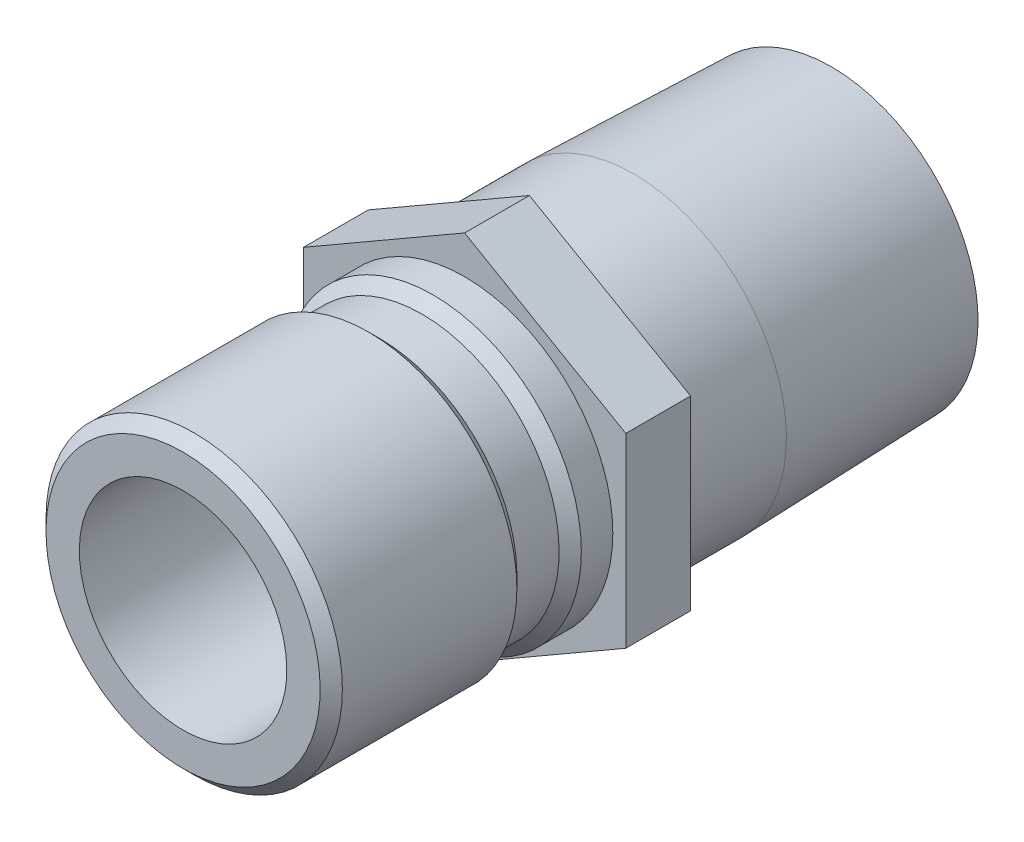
ISO-10303-21;
HEADER;
FILE_DESCRIPTION(('STEP AP214'),'2;1');
FILE_NAME('part.step','',(''),(''),'','','');
FILE_SCHEMA(('AUTOMOTIVE_DESIGN { 1 0 10303 214 1 1 1 1 }'));
ENDSEC;
DATA;
#1=APPLICATION_CONTEXT('core data for automotive mechanical design processes');
#2=APPLICATION_PROTOCOL_DEFINITION('international standard','automotive_design',2000,#1);
#3=PRODUCT_CONTEXT('',#1,'mechanical');
#4=PRODUCT('Part','Part','',(#3));
#5=PRODUCT_RELATED_PRODUCT_CATEGORY('part','',(#4));
#6=PRODUCT_DEFINITION_FORMATION('','',#4);
#7=PRODUCT_DEFINITION_CONTEXT('part definition',#1,'design');
#8=PRODUCT_DEFINITION('design','',#6,#7);
#9=PRODUCT_DEFINITION_SHAPE('','',#8);
#10=(LENGTH_UNIT() NAMED_UNIT(*) SI_UNIT(.MILLI.,.METRE.));
#11=(NAMED_UNIT(*) PLANE_ANGLE_UNIT() SI_UNIT($,.RADIAN.));
#12=(NAMED_UNIT(*) SI_UNIT($,.STERADIAN.) SOLID_ANGLE_UNIT());
#13=UNCERTAINTY_MEASURE_WITH_UNIT(LENGTH_MEASURE(1.E-05),#10,'distance_accuracy_value','');
#14=(GEOMETRIC_REPRESENTATION_CONTEXT(3) GLOBAL_UNCERTAINTY_ASSIGNED_CONTEXT((#13)) GLOBAL_UNIT_ASSIGNED_CONTEXT((#10,
#11,#12)) REPRESENTATION_CONTEXT('',''));
#15=CARTESIAN_POINT('',(0.,0.,0.));
#16=DIRECTION('',(0.,0.,1.));
#17=DIRECTION('',(1.,0.,0.));
#18=AXIS2_PLACEMENT_3D('',#15,#16,#17);
#19=CARTESIAN_POINT('',(0.,0.,0.));
#20=DIRECTION('',(0.,0.,-1.));
#21=DIRECTION('',(0.,1.,0.));
#22=AXIS2_PLACEMENT_3D('',#19,#20,#21);
#23=CYLINDRICAL_SURFACE('',#22,10.4775);
#24=CARTESIAN_POINT('',(0.,0.,-11.5824));
#25=DIRECTION('',(0.,0.,-1.));
#26=DIRECTION('',(0.,1.,0.));
#27=AXIS2_PLACEMENT_3D('',#24,#25,#26);
#28=CIRCLE('',#27,10.4775);
#29=CARTESIAN_POINT('',(0.,10.4775,-11.5824));
#30=VERTEX_POINT('',#29);
#31=EDGE_CURVE('E42',#30,#30,#28,.T.);
#32=ORIENTED_EDGE('',*,*,#31,.F.);
#33=EDGE_LOOP('',(#32));
#34=FACE_BOUND('',#33,.T.);
#35=CARTESIAN_POINT('',(0.,0.,-4.445));
#36=DIRECTION('',(0.,0.,1.));
#37=DIRECTION('',(1.,0.,0.));
#38=AXIS2_PLACEMENT_3D('',#35,#36,#37);
#39=CIRCLE('',#38,10.4775);
#40=CARTESIAN_POINT('',(10.4775,0.,-4.445));
#41=VERTEX_POINT('',#40);
#42=EDGE_CURVE('E138',#41,#41,#39,.F.);
#43=ORIENTED_EDGE('',*,*,#42,.T.);
#44=EDGE_LOOP('',(#43));
#45=FACE_BOUND('',#44,.T.);
#46=ADVANCED_FACE('F33',(#34,#45),#23,.T.);
#47=CARTESIAN_POINT('',(0.,10.053640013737,-25.146));
#48=DIRECTION('',(0.,0.,-1.));
#49=DIRECTION('',(0.,1.,0.));
#50=AXIS2_PLACEMENT_3D('',#47,#48,#49);
#51=PLANE('',#50);
#52=CARTESIAN_POINT('',(0.,0.,-25.146));
#53=DIRECTION('',(0.,0.,-1.));
#54=DIRECTION('',(0.,1.,0.));
#55=AXIS2_PLACEMENT_3D('',#52,#53,#54);
#56=CIRCLE('',#55,10.053640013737);
#57=CARTESIAN_POINT('',(0.,10.053640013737,-25.146));
#58=VERTEX_POINT('',#57);
#59=EDGE_CURVE('E12',#58,#58,#56,.T.);
#60=ORIENTED_EDGE('',*,*,#59,.T.);
#61=EDGE_LOOP('',(#60));
#62=FACE_BOUND('',#61,.T.);
#63=CARTESIAN_POINT('',(0.,0.,-25.146));
#64=DIRECTION('',(0.,0.,-1.));
#65=DIRECTION('',(0.,1.,0.));
#66=AXIS2_PLACEMENT_3D('',#63,#64,#65);
#67=CIRCLE('',#66,7.8994);
#68=CARTESIAN_POINT('',(0.,7.8994,-25.146));
#69=VERTEX_POINT('',#68);
#70=EDGE_CURVE('E146',#69,#69,#67,.T.);
#71=ORIENTED_EDGE('',*,*,#70,.F.);
#72=EDGE_LOOP('',(#71));
#73=FACE_BOUND('',#72,.T.);
#74=ADVANCED_FACE('F35',(#62,#73),#51,.T.);
#75=CARTESIAN_POINT('',(0.,0.,-25.146));
#76=DIRECTION('',(0.,0.,1.));
#77=DIRECTION('',(0.,-1.,0.));
#78=AXIS2_PLACEMENT_3D('',#75,#76,#77);
#79=CONICAL_SURFACE('',#78,10.053640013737,0.0312396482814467);
#80=ORIENTED_EDGE('',*,*,#31,.T.);
#81=EDGE_LOOP('',(#80));
#82=FACE_BOUND('',#81,.T.);
#83=ORIENTED_EDGE('',*,*,#59,.F.);
#84=EDGE_LOOP('',(#83));
#85=FACE_BOUND('',#84,.T.);
#86=ADVANCED_FACE('F181',(#82,#85),#79,.T.);
#87=CARTESIAN_POINT('',(0.,10.16,0.));
#88=DIRECTION('',(0.,0.,1.));
#89=DIRECTION('',(0.,-1.,0.));
#90=AXIS2_PLACEMENT_3D('',#87,#88,#89);
#91=PLANE('',#90);
#92=CARTESIAN_POINT('',(0.,0.,0.));
#93=DIRECTION('',(0.,0.,-1.));
#94=DIRECTION('',(0.,1.,0.));
#95=AXIS2_PLACEMENT_3D('',#92,#93,#94);
#96=CIRCLE('',#95,10.16);
#97=CARTESIAN_POINT('',(0.,10.16,0.));
#98=VERTEX_POINT('',#97);
#99=EDGE_CURVE('E176',#98,#98,#96,.T.);
#100=ORIENTED_EDGE('',*,*,#99,.T.);
#101=EDGE_LOOP('',(#100));
#102=FACE_BOUND('',#101,.T.);
#103=DIRECTION('',(-0.866025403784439,-0.5,0.));
#104=VECTOR('',#103,1.);
#105=CARTESIAN_POINT('',(0.,12.7582862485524,0.));
#106=LINE('',#105,#104);
#107=CARTESIAN_POINT('',(0.,12.7582862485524,0.));
#108=VERTEX_POINT('',#107);
#109=CARTESIAN_POINT('',(-11.049,6.37914312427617,0.));
#110=VERTEX_POINT('',#109);
#111=EDGE_CURVE('E121',#108,#110,#106,.T.);
#112=ORIENTED_EDGE('',*,*,#111,.T.);
#113=DIRECTION('',(0.,-1.,0.));
#114=VECTOR('',#113,1.);
#115=CARTESIAN_POINT('',(-11.049,6.37914312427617,0.));
#116=LINE('',#115,#114);
#117=CARTESIAN_POINT('',(-11.049,-6.37914312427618,0.));
#118=VERTEX_POINT('',#117);
#119=EDGE_CURVE('E124',#110,#118,#116,.T.);
#120=ORIENTED_EDGE('',*,*,#119,.T.);
#121=DIRECTION('',(0.866025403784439,-0.5,0.));
#122=VECTOR('',#121,1.);
#123=CARTESIAN_POINT('',(-11.049,-6.37914312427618,0.));
#124=LINE('',#123,#122);
#125=CARTESIAN_POINT('',(0.,-12.7582862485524,0.));
#126=VERTEX_POINT('',#125);
#127=EDGE_CURVE('E127',#118,#126,#124,.T.);
#128=ORIENTED_EDGE('',*,*,#127,.T.);
#129=DIRECTION('',(0.866025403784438,0.5,0.));
#130=VECTOR('',#129,1.);
#131=CARTESIAN_POINT('',(0.,-12.7582862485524,0.));
#132=LINE('',#131,#130);
#133=CARTESIAN_POINT('',(11.049,-6.37914312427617,0.));
#134=VERTEX_POINT('',#133);
#135=EDGE_CURVE('E130',#126,#134,#132,.T.);
#136=ORIENTED_EDGE('',*,*,#135,.T.);
#137=DIRECTION('',(0.,1.,0.));
#138=VECTOR('',#137,1.);
#139=CARTESIAN_POINT('',(11.049,-6.37914312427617,0.));
#140=LINE('',#139,#138);
#141=CARTESIAN_POINT('',(11.049,6.37914312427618,0.));
#142=VERTEX_POINT('',#141);
#143=EDGE_CURVE('E98',#134,#142,#140,.T.);
#144=ORIENTED_EDGE('',*,*,#143,.T.);
#145=DIRECTION('',(-0.866025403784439,0.5,0.));
#146=VECTOR('',#145,1.);
#147=CARTESIAN_POINT('',(11.049,6.37914312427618,0.));
#148=LINE('',#147,#146);
#149=EDGE_CURVE('E133',#142,#108,#148,.T.);
#150=ORIENTED_EDGE('',*,*,#149,.T.);
#151=EDGE_LOOP('',(#112,#120,#128,#136,#144,#150));
#152=FACE_BOUND('',#151,.T.);
#153=ADVANCED_FACE('F250',(#102,#152),#91,.T.);
#154=CARTESIAN_POINT('',(0.,0.,0.));
#155=DIRECTION('',(0.,0.,-1.));
#156=DIRECTION('',(0.,1.,0.));
#157=AXIS2_PLACEMENT_3D('',#154,#155,#156);
#158=CYLINDRICAL_SURFACE('',#157,10.16);
#159=CARTESIAN_POINT('',(0.,0.,2.159));
#160=DIRECTION('',(0.,0.,-1.));
#161=DIRECTION('',(0.,1.,0.));
#162=AXIS2_PLACEMENT_3D('',#159,#160,#161);
#163=CIRCLE('',#162,10.16);
#164=CARTESIAN_POINT('',(0.,10.16,2.159));
#165=VERTEX_POINT('',#164);
#166=EDGE_CURVE('E173',#165,#165,#163,.T.);
#167=ORIENTED_EDGE('',*,*,#166,.T.);
#168=EDGE_LOOP('',(#167));
#169=FACE_BOUND('',#168,.T.);
#170=ORIENTED_EDGE('',*,*,#99,.F.);
#171=EDGE_LOOP('',(#170));
#172=FACE_BOUND('',#171,.T.);
#173=ADVANCED_FACE('F246',(#169,#172),#158,.T.);
#174=CARTESIAN_POINT('',(0.,0.,2.159));
#175=DIRECTION('',(0.,0.,-1.));
#176=DIRECTION('',(0.,1.,0.));
#177=AXIS2_PLACEMENT_3D('',#174,#175,#176);
#178=CONICAL_SURFACE('',#177,10.16,0.785398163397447);
#179=CARTESIAN_POINT('',(0.,0.,2.921));
#180=DIRECTION('',(0.,0.,-1.));
#181=DIRECTION('',(0.,1.,0.));
#182=AXIS2_PLACEMENT_3D('',#179,#180,#181);
#183=CIRCLE('',#182,9.398);
#184=CARTESIAN_POINT('',(0.,9.398,2.921));
#185=VERTEX_POINT('',#184);
#186=EDGE_CURVE('E170',#185,#185,#183,.T.);
#187=ORIENTED_EDGE('',*,*,#186,.T.);
#188=EDGE_LOOP('',(#187));
#189=FACE_BOUND('',#188,.T.);
#190=ORIENTED_EDGE('',*,*,#166,.F.);
#191=EDGE_LOOP('',(#190));
#192=FACE_BOUND('',#191,.T.);
#193=ADVANCED_FACE('F242',(#189,#192),#178,.T.);
#194=CARTESIAN_POINT('',(0.,0.,0.));
#195=DIRECTION('',(0.,0.,-1.));
#196=DIRECTION('',(0.,1.,0.));
#197=AXIS2_PLACEMENT_3D('',#194,#195,#196);
#198=CYLINDRICAL_SURFACE('',#197,9.398);
#199=CARTESIAN_POINT('',(0.,0.,5.8166));
#200=DIRECTION('',(0.,0.,-1.));
#201=DIRECTION('',(0.,1.,0.));
#202=AXIS2_PLACEMENT_3D('',#199,#200,#201);
#203=CIRCLE('',#202,9.398);
#204=CARTESIAN_POINT('',(0.,9.398,5.8166));
#205=VERTEX_POINT('',#204);
#206=EDGE_CURVE('E167',#205,#205,#203,.T.);
#207=ORIENTED_EDGE('',*,*,#206,.T.);
#208=EDGE_LOOP('',(#207));
#209=FACE_BOUND('',#208,.T.);
#210=ORIENTED_EDGE('',*,*,#186,.F.);
#211=EDGE_LOOP('',(#210));
#212=FACE_BOUND('',#211,.T.);
#213=ADVANCED_FACE('F238',(#209,#212),#198,.T.);
#214=CARTESIAN_POINT('',(0.,0.,5.8166));
#215=DIRECTION('',(0.,0.,1.));
#216=DIRECTION('',(0.,-1.,0.));
#217=AXIS2_PLACEMENT_3D('',#214,#215,#216);
#218=CONICAL_SURFACE('',#217,9.398,0.785398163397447);
#219=CARTESIAN_POINT('',(0.,0.,6.5786));
#220=DIRECTION('',(0.,0.,-1.));
#221=DIRECTION('',(0.,1.,0.));
#222=AXIS2_PLACEMENT_3D('',#219,#220,#221);
#223=CIRCLE('',#222,10.16);
#224=CARTESIAN_POINT('',(0.,10.16,6.5786));
#225=VERTEX_POINT('',#224);
#226=EDGE_CURVE('E164',#225,#225,#223,.T.);
#227=ORIENTED_EDGE('',*,*,#226,.T.);
#228=EDGE_LOOP('',(#227));
#229=FACE_BOUND('',#228,.T.);
#230=ORIENTED_EDGE('',*,*,#206,.F.);
#231=EDGE_LOOP('',(#230));
#232=FACE_BOUND('',#231,.T.);
#233=ADVANCED_FACE('F234',(#229,#232),#218,.T.);
#234=CARTESIAN_POINT('',(0.,0.,0.));
#235=DIRECTION('',(0.,0.,-1.));
#236=DIRECTION('',(0.,1.,0.));
#237=AXIS2_PLACEMENT_3D('',#234,#235,#236);
#238=CYLINDRICAL_SURFACE('',#237,10.16);
#239=CARTESIAN_POINT('',(0.,0.,18.542));
#240=DIRECTION('',(0.,0.,-1.));
#241=DIRECTION('',(0.,1.,0.));
#242=AXIS2_PLACEMENT_3D('',#239,#240,#241);
#243=CIRCLE('',#242,10.16);
#244=CARTESIAN_POINT('',(0.,10.16,18.542));
#245=VERTEX_POINT('',#244);
#246=EDGE_CURVE('E161',#245,#245,#243,.T.);
#247=ORIENTED_EDGE('',*,*,#246,.T.);
#248=EDGE_LOOP('',(#247));
#249=FACE_BOUND('',#248,.T.);
#250=ORIENTED_EDGE('',*,*,#226,.F.);
#251=EDGE_LOOP('',(#250));
#252=FACE_BOUND('',#251,.T.);
#253=ADVANCED_FACE('F230',(#249,#252),#238,.T.);
#254=CARTESIAN_POINT('',(0.,0.,18.542));
#255=DIRECTION('',(0.,0.,-1.));
#256=DIRECTION('',(0.,1.,0.));
#257=AXIS2_PLACEMENT_3D('',#254,#255,#256);
#258=CONICAL_SURFACE('',#257,10.16,0.785398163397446);
#259=CARTESIAN_POINT('',(0.,0.,19.304));
#260=DIRECTION('',(0.,0.,-1.));
#261=DIRECTION('',(0.,1.,0.));
#262=AXIS2_PLACEMENT_3D('',#259,#260,#261);
#263=CIRCLE('',#262,9.398);
#264=CARTESIAN_POINT('',(0.,9.398,19.304));
#265=VERTEX_POINT('',#264);
#266=EDGE_CURVE('E158',#265,#265,#263,.T.);
#267=ORIENTED_EDGE('',*,*,#266,.T.);
#268=EDGE_LOOP('',(#267));
#269=FACE_BOUND('',#268,.T.);
#270=ORIENTED_EDGE('',*,*,#246,.F.);
#271=EDGE_LOOP('',(#270));
#272=FACE_BOUND('',#271,.T.);
#273=ADVANCED_FACE('F226',(#269,#272),#258,.T.);
#274=CARTESIAN_POINT('',(0.,7.112,19.304));
#275=DIRECTION('',(0.,0.,1.));
#276=DIRECTION('',(0.,-1.,0.));
#277=AXIS2_PLACEMENT_3D('',#274,#275,#276);
#278=PLANE('',#277);
#279=CARTESIAN_POINT('',(0.,0.,19.304));
#280=DIRECTION('',(0.,0.,-1.));
#281=DIRECTION('',(0.,1.,0.));
#282=AXIS2_PLACEMENT_3D('',#279,#280,#281);
#283=CIRCLE('',#282,7.112);
#284=CARTESIAN_POINT('',(0.,7.112,19.304));
#285=VERTEX_POINT('',#284);
#286=EDGE_CURVE('E155',#285,#285,#283,.T.);
#287=ORIENTED_EDGE('',*,*,#286,.T.);
#288=EDGE_LOOP('',(#287));
#289=FACE_BOUND('',#288,.T.);
#290=ORIENTED_EDGE('',*,*,#266,.F.);
#291=EDGE_LOOP('',(#290));
#292=FACE_BOUND('',#291,.T.);
#293=ADVANCED_FACE('F222',(#289,#292),#278,.T.);
#294=CARTESIAN_POINT('',(0.,0.,0.));
#295=DIRECTION('',(0.,0.,-1.));
#296=DIRECTION('',(0.,1.,0.));
#297=AXIS2_PLACEMENT_3D('',#294,#295,#296);
#298=CYLINDRICAL_SURFACE('',#297,7.112);
#299=CARTESIAN_POINT('',(0.,0.,1.524));
#300=DIRECTION('',(0.,0.,-1.));
#301=DIRECTION('',(0.,1.,0.));
#302=AXIS2_PLACEMENT_3D('',#299,#300,#301);
#303=CIRCLE('',#302,7.112);
#304=CARTESIAN_POINT('',(0.,7.112,1.524));
#305=VERTEX_POINT('',#304);
#306=EDGE_CURVE('E152',#305,#305,#303,.T.);
#307=ORIENTED_EDGE('',*,*,#306,.T.);
#308=EDGE_LOOP('',(#307));
#309=FACE_BOUND('',#308,.T.);
#310=ORIENTED_EDGE('',*,*,#286,.F.);
#311=EDGE_LOOP('',(#310));
#312=FACE_BOUND('',#311,.T.);
#313=ADVANCED_FACE('F218',(#309,#312),#298,.F.);
#314=CARTESIAN_POINT('',(0.,0.,1.524));
#315=DIRECTION('',(0.,0.,-1.));
#316=DIRECTION('',(0.,1.,0.));
#317=AXIS2_PLACEMENT_3D('',#314,#315,#316);
#318=CONICAL_SURFACE('',#317,7.112,1.08210413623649);
#319=CARTESIAN_POINT('',(0.,0.,1.10533199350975));
#320=DIRECTION('',(0.,0.,-1.));
#321=DIRECTION('',(0.,1.,0.));
#322=AXIS2_PLACEMENT_3D('',#319,#320,#321);
#323=CIRCLE('',#322,7.8994);
#324=CARTESIAN_POINT('',(0.,7.8994,1.10533199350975));
#325=VERTEX_POINT('',#324);
#326=EDGE_CURVE('E149',#325,#325,#323,.T.);
#327=ORIENTED_EDGE('',*,*,#326,.T.);
#328=EDGE_LOOP('',(#327));
#329=FACE_BOUND('',#328,.T.);
#330=ORIENTED_EDGE('',*,*,#306,.F.);
#331=EDGE_LOOP('',(#330));
#332=FACE_BOUND('',#331,.T.);
#333=ADVANCED_FACE('F214',(#329,#332),#318,.F.);
#334=CARTESIAN_POINT('',(0.,0.,0.));
#335=DIRECTION('',(0.,0.,-1.));
#336=DIRECTION('',(0.,1.,0.));
#337=AXIS2_PLACEMENT_3D('',#334,#335,#336);
#338=CYLINDRICAL_SURFACE('',#337,7.8994);
#339=ORIENTED_EDGE('',*,*,#326,.F.);
#340=EDGE_LOOP('',(#339));
#341=FACE_BOUND('',#340,.T.);
#342=ORIENTED_EDGE('',*,*,#70,.T.);
#343=EDGE_LOOP('',(#342));
#344=FACE_BOUND('',#343,.T.);
#345=ADVANCED_FACE('F211',(#341,#344),#338,.F.);
#346=CARTESIAN_POINT('',(0.,12.7582862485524,-4.445));
#347=DIRECTION('',(-0.5,0.866025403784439,0.));
#348=DIRECTION('',(-0.866025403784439,-0.5,0.));
#349=AXIS2_PLACEMENT_3D('',#346,#347,#348);
#350=PLANE('',#349);
#351=ORIENTED_EDGE('',*,*,#111,.F.);
#352=DIRECTION('',(0.,0.,1.));
#353=VECTOR('',#352,1.);
#354=CARTESIAN_POINT('',(0.,12.7582862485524,-4.445));
#355=LINE('',#354,#353);
#356=CARTESIAN_POINT('',(0.,12.7582862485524,-4.445));
#357=VERTEX_POINT('',#356);
#358=EDGE_CURVE('E50',#357,#108,#355,.T.);
#359=ORIENTED_EDGE('',*,*,#358,.F.);
#360=DIRECTION('',(-0.866025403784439,-0.5,0.));
#361=VECTOR('',#360,1.);
#362=CARTESIAN_POINT('',(0.,12.7582862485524,-4.445));
#363=LINE('',#362,#361);
#364=CARTESIAN_POINT('',(-11.049,6.37914312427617,-4.445));
#365=VERTEX_POINT('',#364);
#366=EDGE_CURVE('E136',#357,#365,#363,.T.);
#367=ORIENTED_EDGE('',*,*,#366,.T.);
#368=DIRECTION('',(0.,0.,1.));
#369=VECTOR('',#368,1.);
#370=CARTESIAN_POINT('',(-11.049,6.37914312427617,-4.445));
#371=LINE('',#370,#369);
#372=EDGE_CURVE('E85',#365,#110,#371,.T.);
#373=ORIENTED_EDGE('',*,*,#372,.T.);
#374=EDGE_LOOP('',(#351,#359,#367,#373));
#375=FACE_BOUND('',#374,.T.);
#376=ADVANCED_FACE('F201',(#375),#350,.T.);
#377=CARTESIAN_POINT('',(11.049,6.37914312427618,-4.445));
#378=DIRECTION('',(0.5,0.866025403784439,0.));
#379=DIRECTION('',(-0.866025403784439,0.5,0.));
#380=AXIS2_PLACEMENT_3D('',#377,#378,#379);
#381=PLANE('',#380);
#382=ORIENTED_EDGE('',*,*,#149,.F.);
#383=DIRECTION('',(0.,0.,1.));
#384=VECTOR('',#383,1.);
#385=CARTESIAN_POINT('',(11.049,6.37914312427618,-4.445));
#386=LINE('',#385,#384);
#387=CARTESIAN_POINT('',(11.049,6.37914312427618,-4.445));
#388=VERTEX_POINT('',#387);
#389=EDGE_CURVE('E73',#388,#142,#386,.T.);
#390=ORIENTED_EDGE('',*,*,#389,.F.);
#391=DIRECTION('',(-0.866025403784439,0.5,0.));
#392=VECTOR('',#391,1.);
#393=CARTESIAN_POINT('',(11.049,6.37914312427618,-4.445));
#394=LINE('',#393,#392);
#395=EDGE_CURVE('E111',#388,#357,#394,.T.);
#396=ORIENTED_EDGE('',*,*,#395,.T.);
#397=ORIENTED_EDGE('',*,*,#358,.T.);
#398=EDGE_LOOP('',(#382,#390,#396,#397));
#399=FACE_BOUND('',#398,.T.);
#400=ADVANCED_FACE('F198',(#399),#381,.T.);
#401=CARTESIAN_POINT('',(11.049,-6.37914312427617,-4.445));
#402=DIRECTION('',(1.,0.,0.));
#403=DIRECTION('',(0.,0.,-1.));
#404=AXIS2_PLACEMENT_3D('',#401,#402,#403);
#405=PLANE('',#404);
#406=ORIENTED_EDGE('',*,*,#143,.F.);
#407=DIRECTION('',(0.,0.,1.));
#408=VECTOR('',#407,1.);
#409=CARTESIAN_POINT('',(11.049,-6.37914312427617,-4.445));
#410=LINE('',#409,#408);
#411=CARTESIAN_POINT('',(11.049,-6.37914312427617,-4.445));
#412=VERTEX_POINT('',#411);
#413=EDGE_CURVE('E93',#412,#134,#410,.T.);
#414=ORIENTED_EDGE('',*,*,#413,.F.);
#415=DIRECTION('',(0.,1.,0.));
#416=VECTOR('',#415,1.);
#417=CARTESIAN_POINT('',(11.049,-6.37914312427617,-4.445));
#418=LINE('',#417,#416);
#419=EDGE_CURVE('E96',#412,#388,#418,.T.);
#420=ORIENTED_EDGE('',*,*,#419,.T.);
#421=ORIENTED_EDGE('',*,*,#389,.T.);
#422=EDGE_LOOP('',(#406,#414,#420,#421));
#423=FACE_BOUND('',#422,.T.);
#424=ADVANCED_FACE('F95',(#423),#405,.T.);
#425=CARTESIAN_POINT('',(0.,-12.7582862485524,-4.445));
#426=DIRECTION('',(0.5,-0.866025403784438,0.));
#427=DIRECTION('',(0.866025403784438,0.5,0.));
#428=AXIS2_PLACEMENT_3D('',#425,#426,#427);
#429=PLANE('',#428);
#430=ORIENTED_EDGE('',*,*,#135,.F.);
#431=DIRECTION('',(0.,0.,1.));
#432=VECTOR('',#431,1.);
#433=CARTESIAN_POINT('',(0.,-12.7582862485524,-4.445));
#434=LINE('',#433,#432);
#435=CARTESIAN_POINT('',(0.,-12.7582862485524,-4.445));
#436=VERTEX_POINT('',#435);
#437=EDGE_CURVE('E103',#436,#126,#434,.T.);
#438=ORIENTED_EDGE('',*,*,#437,.F.);
#439=DIRECTION('',(0.866025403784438,0.5,0.));
#440=VECTOR('',#439,1.);
#441=CARTESIAN_POINT('',(0.,-12.7582862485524,-4.445));
#442=LINE('',#441,#440);
#443=EDGE_CURVE('E109',#436,#412,#442,.T.);
#444=ORIENTED_EDGE('',*,*,#443,.T.);
#445=ORIENTED_EDGE('',*,*,#413,.T.);
#446=EDGE_LOOP('',(#430,#438,#444,#445));
#447=FACE_BOUND('',#446,.T.);
#448=ADVANCED_FACE('F113',(#447),#429,.T.);
#449=CARTESIAN_POINT('',(-11.049,-6.37914312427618,-4.445));
#450=DIRECTION('',(-0.5,-0.866025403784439,0.));
#451=DIRECTION('',(0.866025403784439,-0.5,0.));
#452=AXIS2_PLACEMENT_3D('',#449,#450,#451);
#453=PLANE('',#452);
#454=ORIENTED_EDGE('',*,*,#127,.F.);
#455=DIRECTION('',(0.,0.,1.));
#456=VECTOR('',#455,1.);
#457=CARTESIAN_POINT('',(-11.049,-6.37914312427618,-4.445));
#458=LINE('',#457,#456);
#459=CARTESIAN_POINT('',(-11.049,-6.37914312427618,-4.445));
#460=VERTEX_POINT('',#459);
#461=EDGE_CURVE('E141',#460,#118,#458,.T.);
#462=ORIENTED_EDGE('',*,*,#461,.F.);
#463=DIRECTION('',(0.866025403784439,-0.5,0.));
#464=VECTOR('',#463,1.);
#465=CARTESIAN_POINT('',(-11.049,-6.37914312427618,-4.445));
#466=LINE('',#465,#464);
#467=EDGE_CURVE('E114',#460,#436,#466,.T.);
#468=ORIENTED_EDGE('',*,*,#467,.T.);
#469=ORIENTED_EDGE('',*,*,#437,.T.);
#470=EDGE_LOOP('',(#454,#462,#468,#469));
#471=FACE_BOUND('',#470,.T.);
#472=ADVANCED_FACE('F195',(#471),#453,.T.);
#473=CARTESIAN_POINT('',(-11.049,6.37914312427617,-4.445));
#474=DIRECTION('',(-1.,0.,0.));
#475=DIRECTION('',(0.,0.,1.));
#476=AXIS2_PLACEMENT_3D('',#473,#474,#475);
#477=PLANE('',#476);
#478=ORIENTED_EDGE('',*,*,#119,.F.);
#479=ORIENTED_EDGE('',*,*,#372,.F.);
#480=DIRECTION('',(0.,-1.,0.));
#481=VECTOR('',#480,1.);
#482=CARTESIAN_POINT('',(-11.049,6.37914312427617,-4.445));
#483=LINE('',#482,#481);
#484=EDGE_CURVE('E116',#365,#460,#483,.T.);
#485=ORIENTED_EDGE('',*,*,#484,.T.);
#486=ORIENTED_EDGE('',*,*,#461,.T.);
#487=EDGE_LOOP('',(#478,#479,#485,#486));
#488=FACE_BOUND('',#487,.T.);
#489=ADVANCED_FACE('F190',(#488),#477,.T.);
#490=CARTESIAN_POINT('',(-11.049,6.37914312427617,-4.445));
#491=DIRECTION('',(0.,0.,1.));
#492=DIRECTION('',(1.,0.,0.));
#493=AXIS2_PLACEMENT_3D('',#490,#491,#492);
#494=PLANE('',#493);
#495=ORIENTED_EDGE('',*,*,#42,.F.);
#496=EDGE_LOOP('',(#495));
#497=FACE_BOUND('',#496,.T.);
#498=ORIENTED_EDGE('',*,*,#366,.F.);
#499=ORIENTED_EDGE('',*,*,#395,.F.);
#500=ORIENTED_EDGE('',*,*,#419,.F.);
#501=ORIENTED_EDGE('',*,*,#443,.F.);
#502=ORIENTED_EDGE('',*,*,#467,.F.);
#503=ORIENTED_EDGE('',*,*,#484,.F.);
#504=EDGE_LOOP('',(#498,#499,#500,#501,#502,#503));
#505=FACE_BOUND('',#504,.T.);
#506=ADVANCED_FACE('F107',(#497,#505),#494,.F.);
#507=CLOSED_SHELL('',(#46,#74,#86,#153,#173,#193,#213,#233,#253,#273,#293,#313,#333,#345,#376,
#400,#424,#448,#472,#489,#506));
#508=MANIFOLD_SOLID_BREP('B2',#507);
#509=ADVANCED_BREP_SHAPE_REPRESENTATION('',(#18,#508),#14);
#510=SHAPE_DEFINITION_REPRESENTATION(#9,#509);
ENDSEC;
END-ISO-10303-21;
